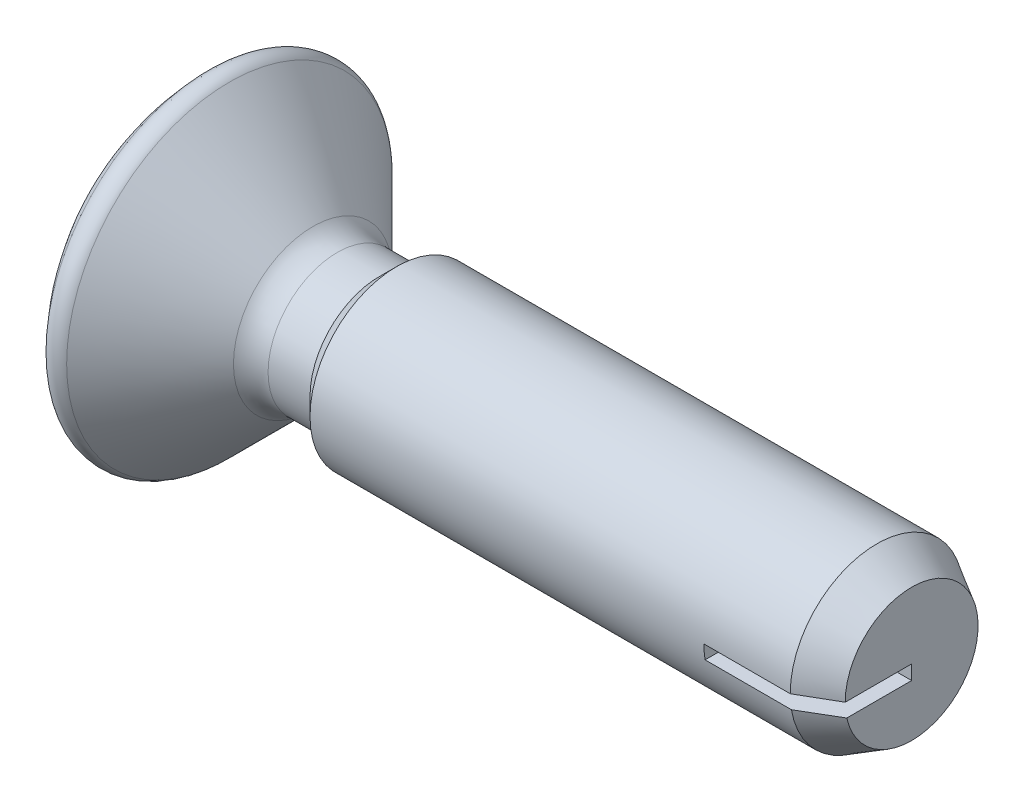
from build123d import *

# Parameters (mm, degrees)
SLOT_CUT_EXTRUDE1_DEPTH      = 17.90568942
SLOT_CUT_EXTRUDE1_DEPTH_BACK = 17.90568942
SKETCH2_W                    = 1
SKETCH2_H                    = 1.2
SKETCH11_W                   = 2.8
SKETCH11_H                   = 0.333333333
POINT_CUT_EXTRUDE8_DEPTH     = 17.90568942


with BuildPart() as part:
    # Sketch1 → base-Revolve (revolve)
    with BuildSketch(Plane.XY, mode=Mode.PRIVATE) as base_revolve_sk:
        with BuildLine():
            Line((0.238648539, 3.761351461), (2.165685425, 1.834314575))
            ThreePointArc((2.165685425, 1.834314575), (2.425224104, 1.660896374), (2.73137085, 1.6))
            Line((2.73137085, 1.6), (3.7, 1.6))
            Line((3.7, 1.6), (4.1, 2))
            Line((4.1, 2), (16, 2))
            Line((16, 2), (16, 0))
            Line((16, 0), (0, 0))
            Line((0, 0), (-1.730540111, 0))
            ThreePointArc((-1.730540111, 0), (-1.345987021, 2.01818082), (-0.246219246, 3.753532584))
            ThreePointArc((-0.246219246, 3.753532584), (-0.005441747, 3.860159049), (0.238648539, 3.761351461))
        make_face()
    revolve(base_revolve_sk.sketch.rotate(Axis((0, 0, 0), (1, 0, 0)), 90), axis=Axis((0, 0, 0), (1, 0, 0)))

    # Sketch2 → slot_Cut-Extrude1 (cut, two sides: drawn at the far end of the back side and taken through both)
    with BuildSketch(Plane.XY.offset(-SLOT_CUT_EXTRUDE1_DEPTH_BACK)):
        with Locations((-1.230540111, 0)):
            Rectangle(SKETCH2_W, SKETCH2_H)
    extrude(amount=SLOT_CUT_EXTRUDE1_DEPTH + SLOT_CUT_EXTRUDE1_DEPTH_BACK, mode=Mode.SUBTRACT)

    # Sketch8 → point_Cut-Revolve1 (revolve, cut)
    with BuildSketch(Plane.XY, mode=Mode.PRIVATE) as point_cut_revolve1_sk:
        Polygon((16, 0), (16.508, 0), (16.508, 2.508), (15.194596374, 2.508), (15.194596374, 2), (16, 1.535), align=None)
    revolve(point_cut_revolve1_sk.sketch.rotate(Axis((0, 0, 0), (1, 0, 0)), 90), axis=Axis((0, 0, 0), (1, 0, 0)), mode=Mode.SUBTRACT)

    # Sketch11 → point_Cut-Extrude8 (cut, through all)
    with BuildSketch(Plane.XY):
        with Locations((14.6, -0.166666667)):
            Rectangle(SKETCH11_W, SKETCH11_H)
    extrude(amount=POINT_CUT_EXTRUDE8_DEPTH, mode=Mode.SUBTRACT)


solid = part.part
